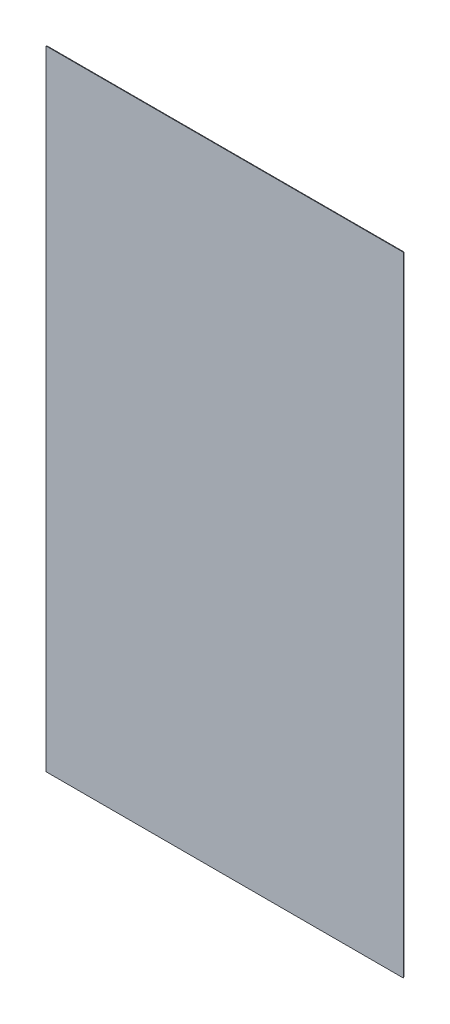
ISO-10303-21;
HEADER;
FILE_DESCRIPTION(('STEP AP214'),'2;1');
FILE_NAME('part.step','',(''),(''),'','','');
FILE_SCHEMA(('AUTOMOTIVE_DESIGN { 1 0 10303 214 1 1 1 1 }'));
ENDSEC;
DATA;
#1=APPLICATION_CONTEXT('core data for automotive mechanical design processes');
#2=APPLICATION_PROTOCOL_DEFINITION('international standard','automotive_design',2000,#1);
#3=PRODUCT_CONTEXT('',#1,'mechanical');
#4=PRODUCT('Part','Part','',(#3));
#5=PRODUCT_RELATED_PRODUCT_CATEGORY('part','',(#4));
#6=PRODUCT_DEFINITION_FORMATION('','',#4);
#7=PRODUCT_DEFINITION_CONTEXT('part definition',#1,'design');
#8=PRODUCT_DEFINITION('design','',#6,#7);
#9=PRODUCT_DEFINITION_SHAPE('','',#8);
#10=(LENGTH_UNIT() NAMED_UNIT(*) SI_UNIT(.MILLI.,.METRE.));
#11=(NAMED_UNIT(*) PLANE_ANGLE_UNIT() SI_UNIT($,.RADIAN.));
#12=(NAMED_UNIT(*) SI_UNIT($,.STERADIAN.) SOLID_ANGLE_UNIT());
#13=UNCERTAINTY_MEASURE_WITH_UNIT(LENGTH_MEASURE(1.E-05),#10,'distance_accuracy_value','');
#14=(GEOMETRIC_REPRESENTATION_CONTEXT(3) GLOBAL_UNCERTAINTY_ASSIGNED_CONTEXT((#13)) GLOBAL_UNIT_ASSIGNED_CONTEXT((#10,
#11,#12)) REPRESENTATION_CONTEXT('',''));
#15=CARTESIAN_POINT('',(0.,0.,0.));
#16=DIRECTION('',(0.,0.,1.));
#17=DIRECTION('',(1.,0.,0.));
#18=AXIS2_PLACEMENT_3D('',#15,#16,#17);
#19=CARTESIAN_POINT('',(0.,-1056.,6.));
#20=DIRECTION('',(0.,1.,0.));
#21=DIRECTION('',(0.,0.,1.));
#22=AXIS2_PLACEMENT_3D('',#19,#20,#21);
#23=PLANE('',#22);
#24=DIRECTION('',(1.,0.,0.));
#25=VECTOR('',#24,1.);
#26=CARTESIAN_POINT('',(0.,-1056.,6.));
#27=LINE('',#26,#25);
#28=CARTESIAN_POINT('',(-8.,-1056.,6.));
#29=VERTEX_POINT('',#28);
#30=CARTESIAN_POINT('',(592.,-1056.,6.));
#31=VERTEX_POINT('',#30);
#32=EDGE_CURVE('E97',#29,#31,#27,.T.);
#33=ORIENTED_EDGE('',*,*,#32,.F.);
#34=CARTESIAN_POINT('',(1.16515138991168,-1056.,10.));
#35=DIRECTION('',(0.,1.,0.));
#36=DIRECTION('',(0.,0.,1.));
#37=AXIS2_PLACEMENT_3D('',#34,#35,#36);
#38=CIRCLE('',#37,10.);
#39=CARTESIAN_POINT('',(1.16515138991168,-1056.,0.));
#40=VERTEX_POINT('',#39);
#41=EDGE_CURVE('E85',#29,#40,#38,.F.);
#42=ORIENTED_EDGE('',*,*,#41,.T.);
#43=DIRECTION('',(1.,0.,0.));
#44=VECTOR('',#43,1.);
#45=CARTESIAN_POINT('',(0.,-1056.,0.));
#46=LINE('',#45,#44);
#47=CARTESIAN_POINT('',(582.834848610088,-1056.,0.));
#48=VERTEX_POINT('',#47);
#49=EDGE_CURVE('E103',#40,#48,#46,.T.);
#50=ORIENTED_EDGE('',*,*,#49,.T.);
#51=CARTESIAN_POINT('',(582.834848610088,-1056.,10.));
#52=DIRECTION('',(0.,1.,0.));
#53=DIRECTION('',(0.,0.,1.));
#54=AXIS2_PLACEMENT_3D('',#51,#52,#53);
#55=CIRCLE('',#54,10.);
#56=EDGE_CURVE('E94',#48,#31,#55,.F.);
#57=ORIENTED_EDGE('',*,*,#56,.T.);
#58=EDGE_LOOP('',(#33,#42,#50,#57));
#59=FACE_BOUND('',#58,.T.);
#60=ADVANCED_FACE('F45',(#59),#23,.F.);
#61=CARTESIAN_POINT('',(0.,0.,6.));
#62=DIRECTION('',(0.,0.,1.));
#63=DIRECTION('',(1.,0.,0.));
#64=AXIS2_PLACEMENT_3D('',#61,#62,#63);
#65=PLANE('',#64);
#66=DIRECTION('',(-1.,0.,0.));
#67=VECTOR('',#66,1.);
#68=CARTESIAN_POINT('',(0.,0.,6.));
#69=LINE('',#68,#67);
#70=CARTESIAN_POINT('',(592.,0.,6.));
#71=VERTEX_POINT('',#70);
#72=CARTESIAN_POINT('',(-8.,0.,6.));
#73=VERTEX_POINT('',#72);
#74=EDGE_CURVE('E107',#71,#73,#69,.T.);
#75=ORIENTED_EDGE('',*,*,#74,.T.);
#76=DIRECTION('',(0.,1.,0.));
#77=VECTOR('',#76,1.);
#78=CARTESIAN_POINT('',(-8.,0.,6.));
#79=LINE('',#78,#77);
#80=EDGE_CURVE('E90',#29,#73,#79,.T.);
#81=ORIENTED_EDGE('',*,*,#80,.F.);
#82=ORIENTED_EDGE('',*,*,#32,.T.);
#83=DIRECTION('',(0.,1.,0.));
#84=VECTOR('',#83,1.);
#85=CARTESIAN_POINT('',(592.,0.,6.));
#86=LINE('',#85,#84);
#87=EDGE_CURVE('E102',#31,#71,#86,.T.);
#88=ORIENTED_EDGE('',*,*,#87,.T.);
#89=EDGE_LOOP('',(#75,#81,#82,#88));
#90=FACE_BOUND('',#89,.T.);
#91=ADVANCED_FACE('F105',(#90),#65,.T.);
#92=CARTESIAN_POINT('',(0.,0.,0.));
#93=DIRECTION('',(0.,0.,1.));
#94=DIRECTION('',(1.,0.,0.));
#95=AXIS2_PLACEMENT_3D('',#92,#93,#94);
#96=PLANE('',#95);
#97=ORIENTED_EDGE('',*,*,#49,.F.);
#98=DIRECTION('',(0.,1.,0.));
#99=VECTOR('',#98,1.);
#100=CARTESIAN_POINT('',(1.16515138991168,0.,0.));
#101=LINE('',#100,#99);
#102=CARTESIAN_POINT('',(1.16515138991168,-9.16515138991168,0.));
#103=VERTEX_POINT('',#102);
#104=EDGE_CURVE('E11',#40,#103,#101,.T.);
#105=ORIENTED_EDGE('',*,*,#104,.T.);
#106=DIRECTION('',(-1.,0.,0.));
#107=VECTOR('',#106,1.);
#108=CARTESIAN_POINT('',(0.,-9.16515138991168,0.));
#109=LINE('',#108,#107);
#110=CARTESIAN_POINT('',(582.834848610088,-9.16515138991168,0.));
#111=VERTEX_POINT('',#110);
#112=EDGE_CURVE('E62',#103,#111,#109,.F.);
#113=ORIENTED_EDGE('',*,*,#112,.T.);
#114=DIRECTION('',(0.,1.,0.));
#115=VECTOR('',#114,1.);
#116=CARTESIAN_POINT('',(582.834848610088,0.,0.));
#117=LINE('',#116,#115);
#118=EDGE_CURVE('E55',#111,#48,#117,.F.);
#119=ORIENTED_EDGE('',*,*,#118,.T.);
#120=EDGE_LOOP('',(#97,#105,#113,#119));
#121=FACE_BOUND('',#120,.T.);
#122=ADVANCED_FACE('F131',(#121),#96,.F.);
#123=CARTESIAN_POINT('',(582.834848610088,0.,10.));
#124=DIRECTION('',(0.,1.,0.));
#125=DIRECTION('',(-1.,0.,0.));
#126=AXIS2_PLACEMENT_3D('',#123,#124,#125);
#127=CYLINDRICAL_SURFACE('',#126,10.);
#128=ORIENTED_EDGE('',*,*,#56,.F.);
#129=ORIENTED_EDGE('',*,*,#118,.F.);
#130=CARTESIAN_POINT('',(582.834848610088,-9.16515138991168,10.));
#131=DIRECTION('',(-0.707106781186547,0.707106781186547,0.));
#132=DIRECTION('',(-0.707106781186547,-0.707106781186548,0.));
#133=AXIS2_PLACEMENT_3D('',#130,#131,#132);
#134=ELLIPSE('',#133,14.1421356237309,10.);
#135=EDGE_CURVE('E49',#71,#111,#134,.T.);
#136=ORIENTED_EDGE('',*,*,#135,.F.);
#137=ORIENTED_EDGE('',*,*,#87,.F.);
#138=EDGE_LOOP('',(#128,#129,#136,#137));
#139=FACE_BOUND('',#138,.T.);
#140=ADVANCED_FACE('F47',(#139),#127,.T.);
#141=CARTESIAN_POINT('',(0.,-9.16515138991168,10.));
#142=DIRECTION('',(-1.,0.,0.));
#143=DIRECTION('',(0.,0.,1.));
#144=AXIS2_PLACEMENT_3D('',#141,#142,#143);
#145=CYLINDRICAL_SURFACE('',#144,10.);
#146=ORIENTED_EDGE('',*,*,#135,.T.);
#147=ORIENTED_EDGE('',*,*,#112,.F.);
#148=CARTESIAN_POINT('',(1.16515138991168,-9.16515138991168,10.));
#149=DIRECTION('',(-0.707106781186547,-0.707106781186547,0.));
#150=DIRECTION('',(-0.707106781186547,0.707106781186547,0.));
#151=AXIS2_PLACEMENT_3D('',#148,#149,#150);
#152=ELLIPSE('',#151,14.1421356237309,10.);
#153=EDGE_CURVE('E115',#73,#103,#152,.T.);
#154=ORIENTED_EDGE('',*,*,#153,.F.);
#155=ORIENTED_EDGE('',*,*,#74,.F.);
#156=EDGE_LOOP('',(#146,#147,#154,#155));
#157=FACE_BOUND('',#156,.T.);
#158=ADVANCED_FACE('F128',(#157),#145,.T.);
#159=CARTESIAN_POINT('',(1.16515138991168,0.,10.));
#160=DIRECTION('',(0.,1.,0.));
#161=DIRECTION('',(0.,0.,1.));
#162=AXIS2_PLACEMENT_3D('',#159,#160,#161);
#163=CYLINDRICAL_SURFACE('',#162,10.);
#164=ORIENTED_EDGE('',*,*,#153,.T.);
#165=ORIENTED_EDGE('',*,*,#104,.F.);
#166=ORIENTED_EDGE('',*,*,#41,.F.);
#167=ORIENTED_EDGE('',*,*,#80,.T.);
#168=EDGE_LOOP('',(#164,#165,#166,#167));
#169=FACE_BOUND('',#168,.T.);
#170=ADVANCED_FACE('F88',(#169),#163,.T.);
#171=CLOSED_SHELL('',(#60,#91,#122,#140,#158,#170));
#172=MANIFOLD_SOLID_BREP('B2',#171);
#173=ADVANCED_BREP_SHAPE_REPRESENTATION('',(#18,#172),#14);
#174=SHAPE_DEFINITION_REPRESENTATION(#9,#173);
ENDSEC;
END-ISO-10303-21;
